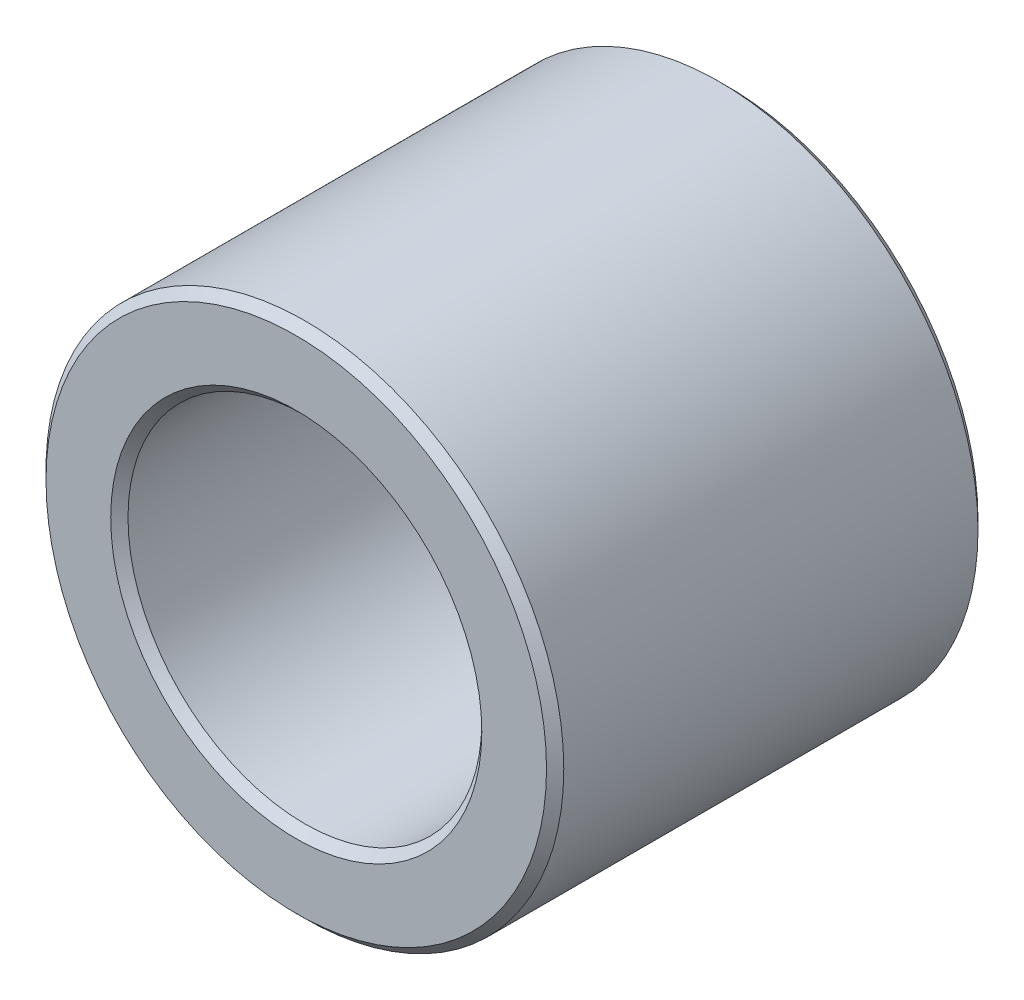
ISO-10303-21;
HEADER;
FILE_DESCRIPTION(('STEP AP214'),'2;1');
FILE_NAME('part.step','',(''),(''),'','','');
FILE_SCHEMA(('AUTOMOTIVE_DESIGN { 1 0 10303 214 1 1 1 1 }'));
ENDSEC;
DATA;
#1=APPLICATION_CONTEXT('core data for automotive mechanical design processes');
#2=APPLICATION_PROTOCOL_DEFINITION('international standard','automotive_design',2000,#1);
#3=PRODUCT_CONTEXT('',#1,'mechanical');
#4=PRODUCT('Part','Part','',(#3));
#5=PRODUCT_RELATED_PRODUCT_CATEGORY('part','',(#4));
#6=PRODUCT_DEFINITION_FORMATION('','',#4);
#7=PRODUCT_DEFINITION_CONTEXT('part definition',#1,'design');
#8=PRODUCT_DEFINITION('design','',#6,#7);
#9=PRODUCT_DEFINITION_SHAPE('','',#8);
#10=(LENGTH_UNIT() NAMED_UNIT(*) SI_UNIT(.MILLI.,.METRE.));
#11=(NAMED_UNIT(*) PLANE_ANGLE_UNIT() SI_UNIT($,.RADIAN.));
#12=(NAMED_UNIT(*) SI_UNIT($,.STERADIAN.) SOLID_ANGLE_UNIT());
#13=UNCERTAINTY_MEASURE_WITH_UNIT(LENGTH_MEASURE(1.E-05),#10,'distance_accuracy_value','');
#14=(GEOMETRIC_REPRESENTATION_CONTEXT(3) GLOBAL_UNCERTAINTY_ASSIGNED_CONTEXT((#13)) GLOBAL_UNIT_ASSIGNED_CONTEXT((#10,
#11,#12)) REPRESENTATION_CONTEXT('',''));
#15=CARTESIAN_POINT('',(0.,0.,0.));
#16=DIRECTION('',(0.,0.,1.));
#17=DIRECTION('',(1.,0.,0.));
#18=AXIS2_PLACEMENT_3D('',#15,#16,#17);
#19=CARTESIAN_POINT('',(0.,0.,5.));
#20=DIRECTION('',(0.,0.,1.));
#21=DIRECTION('',(1.,0.,0.));
#22=AXIS2_PLACEMENT_3D('',#19,#20,#21);
#23=PLANE('',#22);
#24=CARTESIAN_POINT('',(0.,0.,5.));
#25=DIRECTION('',(0.,0.,1.));
#26=DIRECTION('',(1.,0.,0.));
#27=AXIS2_PLACEMENT_3D('',#24,#25,#26);
#28=CIRCLE('',#27,4.3);
#29=CARTESIAN_POINT('',(4.3,0.,5.));
#30=VERTEX_POINT('',#29);
#31=EDGE_CURVE('E10',#30,#30,#28,.F.);
#32=ORIENTED_EDGE('',*,*,#31,.T.);
#33=EDGE_LOOP('',(#32));
#34=FACE_BOUND('',#33,.T.);
#35=CARTESIAN_POINT('',(0.,0.,5.));
#36=DIRECTION('',(0.,0.,1.));
#37=DIRECTION('',(1.,0.,0.));
#38=AXIS2_PLACEMENT_3D('',#35,#36,#37);
#39=CIRCLE('',#38,5.8);
#40=CARTESIAN_POINT('',(5.8,0.,5.));
#41=VERTEX_POINT('',#40);
#42=EDGE_CURVE('E45',#41,#41,#39,.T.);
#43=ORIENTED_EDGE('',*,*,#42,.T.);
#44=EDGE_LOOP('',(#43));
#45=FACE_BOUND('',#44,.T.);
#46=ADVANCED_FACE('F37',(#34,#45),#23,.T.);
#47=CARTESIAN_POINT('',(0.,0.,-5.));
#48=DIRECTION('',(0.,0.,1.));
#49=DIRECTION('',(1.,0.,0.));
#50=AXIS2_PLACEMENT_3D('',#47,#48,#49);
#51=PLANE('',#50);
#52=CARTESIAN_POINT('',(0.,0.,-5.));
#53=DIRECTION('',(0.,0.,1.));
#54=DIRECTION('',(1.,0.,0.));
#55=AXIS2_PLACEMENT_3D('',#52,#53,#54);
#56=CIRCLE('',#55,5.8);
#57=CARTESIAN_POINT('',(5.8,0.,-5.));
#58=VERTEX_POINT('',#57);
#59=EDGE_CURVE('E62',#58,#58,#56,.F.);
#60=ORIENTED_EDGE('',*,*,#59,.T.);
#61=EDGE_LOOP('',(#60));
#62=FACE_BOUND('',#61,.T.);
#63=CARTESIAN_POINT('',(0.,0.,-5.));
#64=DIRECTION('',(0.,0.,1.));
#65=DIRECTION('',(1.,0.,0.));
#66=AXIS2_PLACEMENT_3D('',#63,#64,#65);
#67=CIRCLE('',#66,4.3);
#68=CARTESIAN_POINT('',(4.3,0.,-5.));
#69=VERTEX_POINT('',#68);
#70=EDGE_CURVE('E66',#69,#69,#67,.T.);
#71=ORIENTED_EDGE('',*,*,#70,.T.);
#72=EDGE_LOOP('',(#71));
#73=FACE_BOUND('',#72,.T.);
#74=ADVANCED_FACE('F89',(#62,#73),#51,.F.);
#75=CARTESIAN_POINT('',(0.,0.,5.));
#76=DIRECTION('',(0.,0.,-1.));
#77=DIRECTION('',(-1.,0.,0.));
#78=AXIS2_PLACEMENT_3D('',#75,#76,#77);
#79=CYLINDRICAL_SURFACE('',#78,6.);
#80=CARTESIAN_POINT('',(0.,0.,-4.8));
#81=DIRECTION('',(0.,0.,1.));
#82=DIRECTION('',(1.,0.,0.));
#83=AXIS2_PLACEMENT_3D('',#80,#81,#82);
#84=CIRCLE('',#83,6.);
#85=CARTESIAN_POINT('',(6.,0.,-4.8));
#86=VERTEX_POINT('',#85);
#87=EDGE_CURVE('E70',#86,#86,#84,.T.);
#88=ORIENTED_EDGE('',*,*,#87,.T.);
#89=EDGE_LOOP('',(#88));
#90=FACE_BOUND('',#89,.T.);
#91=CARTESIAN_POINT('',(0.,0.,4.8));
#92=DIRECTION('',(0.,0.,1.));
#93=DIRECTION('',(1.,0.,0.));
#94=AXIS2_PLACEMENT_3D('',#91,#92,#93);
#95=CIRCLE('',#94,6.);
#96=CARTESIAN_POINT('',(6.,0.,4.8));
#97=VERTEX_POINT('',#96);
#98=EDGE_CURVE('E73',#97,#97,#95,.F.);
#99=ORIENTED_EDGE('',*,*,#98,.T.);
#100=EDGE_LOOP('',(#99));
#101=FACE_BOUND('',#100,.T.);
#102=ADVANCED_FACE('F78',(#90,#101),#79,.T.);
#103=CARTESIAN_POINT('',(0.,0.,5.));
#104=DIRECTION('',(0.,0.,-1.));
#105=DIRECTION('',(-1.,0.,0.));
#106=AXIS2_PLACEMENT_3D('',#103,#104,#105);
#107=CYLINDRICAL_SURFACE('',#106,4.1);
#108=CARTESIAN_POINT('',(0.,0.,-4.8));
#109=DIRECTION('',(0.,0.,1.));
#110=DIRECTION('',(1.,0.,0.));
#111=AXIS2_PLACEMENT_3D('',#108,#109,#110);
#112=CIRCLE('',#111,4.1);
#113=CARTESIAN_POINT('',(4.1,0.,-4.8));
#114=VERTEX_POINT('',#113);
#115=EDGE_CURVE('E51',#114,#114,#112,.F.);
#116=ORIENTED_EDGE('',*,*,#115,.T.);
#117=EDGE_LOOP('',(#116));
#118=FACE_BOUND('',#117,.T.);
#119=CARTESIAN_POINT('',(0.,0.,4.8));
#120=DIRECTION('',(0.,0.,1.));
#121=DIRECTION('',(1.,0.,0.));
#122=AXIS2_PLACEMENT_3D('',#119,#120,#121);
#123=CIRCLE('',#122,4.1);
#124=CARTESIAN_POINT('',(4.1,0.,4.8));
#125=VERTEX_POINT('',#124);
#126=EDGE_CURVE('E57',#125,#125,#123,.T.);
#127=ORIENTED_EDGE('',*,*,#126,.T.);
#128=EDGE_LOOP('',(#127));
#129=FACE_BOUND('',#128,.T.);
#130=ADVANCED_FACE('F97',(#118,#129),#107,.F.);
#131=CARTESIAN_POINT('',(0.,0.,-4.8));
#132=DIRECTION('',(0.,0.,1.));
#133=DIRECTION('',(1.,0.,0.));
#134=AXIS2_PLACEMENT_3D('',#131,#132,#133);
#135=CONICAL_SURFACE('',#134,6.,0.785398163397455);
#136=ORIENTED_EDGE('',*,*,#59,.F.);
#137=EDGE_LOOP('',(#136));
#138=FACE_BOUND('',#137,.T.);
#139=ORIENTED_EDGE('',*,*,#87,.F.);
#140=EDGE_LOOP('',(#139));
#141=FACE_BOUND('',#140,.T.);
#142=ADVANCED_FACE('F102',(#138,#141),#135,.T.);
#143=CARTESIAN_POINT('',(0.,0.,-5.));
#144=DIRECTION('',(0.,0.,-1.));
#145=DIRECTION('',(-1.,0.,0.));
#146=AXIS2_PLACEMENT_3D('',#143,#144,#145);
#147=CONICAL_SURFACE('',#146,4.3,0.785398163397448);
#148=ORIENTED_EDGE('',*,*,#115,.F.);
#149=EDGE_LOOP('',(#148));
#150=FACE_BOUND('',#149,.T.);
#151=ORIENTED_EDGE('',*,*,#70,.F.);
#152=EDGE_LOOP('',(#151));
#153=FACE_BOUND('',#152,.T.);
#154=ADVANCED_FACE('F86',(#150,#153),#147,.F.);
#155=CARTESIAN_POINT('',(0.,0.,4.8));
#156=DIRECTION('',(0.,0.,1.));
#157=DIRECTION('',(1.,0.,0.));
#158=AXIS2_PLACEMENT_3D('',#155,#156,#157);
#159=CONICAL_SURFACE('',#158,4.1,0.78539816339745);
#160=ORIENTED_EDGE('',*,*,#31,.F.);
#161=EDGE_LOOP('',(#160));
#162=FACE_BOUND('',#161,.T.);
#163=ORIENTED_EDGE('',*,*,#126,.F.);
#164=EDGE_LOOP('',(#163));
#165=FACE_BOUND('',#164,.T.);
#166=ADVANCED_FACE('F82',(#162,#165),#159,.F.);
#167=CARTESIAN_POINT('',(0.,0.,5.));
#168=DIRECTION('',(0.,0.,-1.));
#169=DIRECTION('',(-1.,0.,0.));
#170=AXIS2_PLACEMENT_3D('',#167,#168,#169);
#171=CONICAL_SURFACE('',#170,5.8,0.785398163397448);
#172=ORIENTED_EDGE('',*,*,#98,.F.);
#173=EDGE_LOOP('',(#172));
#174=FACE_BOUND('',#173,.T.);
#175=ORIENTED_EDGE('',*,*,#42,.F.);
#176=EDGE_LOOP('',(#175));
#177=FACE_BOUND('',#176,.T.);
#178=ADVANCED_FACE('F39',(#174,#177),#171,.T.);
#179=CLOSED_SHELL('',(#46,#74,#102,#130,#142,#154,#166,#178));
#180=MANIFOLD_SOLID_BREP('B2',#179);
#181=ADVANCED_BREP_SHAPE_REPRESENTATION('',(#18,#180),#14);
#182=SHAPE_DEFINITION_REPRESENTATION(#9,#181);
ENDSEC;
END-ISO-10303-21;
